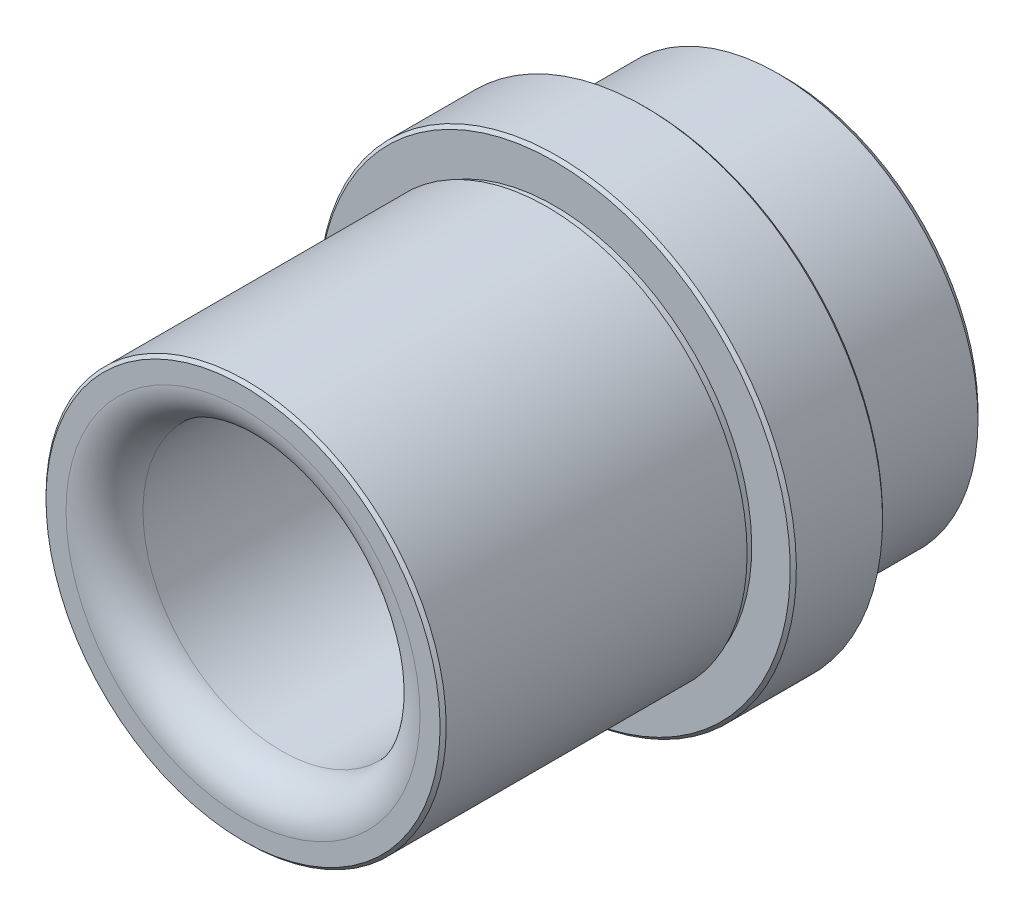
ISO-10303-21;
HEADER;
FILE_DESCRIPTION(('STEP AP214'),'2;1');
FILE_NAME('part.step','',(''),(''),'','','');
FILE_SCHEMA(('AUTOMOTIVE_DESIGN { 1 0 10303 214 1 1 1 1 }'));
ENDSEC;
DATA;
#1=APPLICATION_CONTEXT('core data for automotive mechanical design processes');
#2=APPLICATION_PROTOCOL_DEFINITION('international standard','automotive_design',2000,#1);
#3=PRODUCT_CONTEXT('',#1,'mechanical');
#4=PRODUCT('Part','Part','',(#3));
#5=PRODUCT_RELATED_PRODUCT_CATEGORY('part','',(#4));
#6=PRODUCT_DEFINITION_FORMATION('','',#4);
#7=PRODUCT_DEFINITION_CONTEXT('part definition',#1,'design');
#8=PRODUCT_DEFINITION('design','',#6,#7);
#9=PRODUCT_DEFINITION_SHAPE('','',#8);
#10=(LENGTH_UNIT() NAMED_UNIT(*) SI_UNIT(.MILLI.,.METRE.));
#11=(NAMED_UNIT(*) PLANE_ANGLE_UNIT() SI_UNIT($,.RADIAN.));
#12=(NAMED_UNIT(*) SI_UNIT($,.STERADIAN.) SOLID_ANGLE_UNIT());
#13=UNCERTAINTY_MEASURE_WITH_UNIT(LENGTH_MEASURE(1.E-05),#10,'distance_accuracy_value','');
#14=(GEOMETRIC_REPRESENTATION_CONTEXT(3) GLOBAL_UNCERTAINTY_ASSIGNED_CONTEXT((#13)) GLOBAL_UNIT_ASSIGNED_CONTEXT((#10,
#11,#12)) REPRESENTATION_CONTEXT('',''));
#15=CARTESIAN_POINT('',(0.,0.,0.));
#16=DIRECTION('',(0.,0.,1.));
#17=DIRECTION('',(1.,0.,0.));
#18=AXIS2_PLACEMENT_3D('',#15,#16,#17);
#19=CARTESIAN_POINT('',(0.,15.3,6.25000000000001));
#20=DIRECTION('',(0.,0.,-1.));
#21=DIRECTION('',(0.,1.,0.));
#22=AXIS2_PLACEMENT_3D('',#19,#20,#21);
#23=PLANE('',#22);
#24=CARTESIAN_POINT('',(0.,0.,6.25000000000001));
#25=DIRECTION('',(0.,0.,1.));
#26=DIRECTION('',(0.,-1.,0.));
#27=AXIS2_PLACEMENT_3D('',#24,#25,#26);
#28=CIRCLE('',#27,12.8000000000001);
#29=CARTESIAN_POINT('',(0.,-12.8000000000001,6.25000000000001));
#30=VERTEX_POINT('',#29);
#31=EDGE_CURVE('E89',#30,#30,#28,.T.);
#32=ORIENTED_EDGE('',*,*,#31,.F.);
#33=EDGE_LOOP('',(#32));
#34=FACE_BOUND('',#33,.T.);
#35=CARTESIAN_POINT('',(0.,0.,6.25000000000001));
#36=DIRECTION('',(0.,0.,1.));
#37=DIRECTION('',(0.,-1.,0.));
#38=AXIS2_PLACEMENT_3D('',#35,#36,#37);
#39=CIRCLE('',#38,15.3);
#40=CARTESIAN_POINT('',(0.,-15.3,6.25000000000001));
#41=VERTEX_POINT('',#40);
#42=EDGE_CURVE('E10',#41,#41,#39,.T.);
#43=ORIENTED_EDGE('',*,*,#42,.T.);
#44=EDGE_LOOP('',(#43));
#45=FACE_BOUND('',#44,.T.);
#46=ADVANCED_FACE('F34',(#34,#45),#23,.F.);
#47=CARTESIAN_POINT('',(0.,0.,6.05000000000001));
#48=DIRECTION('',(0.,0.,-1.));
#49=DIRECTION('',(0.,1.,0.));
#50=AXIS2_PLACEMENT_3D('',#47,#48,#49);
#51=CONICAL_SURFACE('',#50,15.5,0.785398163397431);
#52=ORIENTED_EDGE('',*,*,#42,.F.);
#53=EDGE_LOOP('',(#52));
#54=FACE_BOUND('',#53,.T.);
#55=CARTESIAN_POINT('',(0.,0.,6.05000000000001));
#56=DIRECTION('',(0.,0.,1.));
#57=DIRECTION('',(0.,-1.,0.));
#58=AXIS2_PLACEMENT_3D('',#55,#56,#57);
#59=CIRCLE('',#58,15.5);
#60=CARTESIAN_POINT('',(0.,-15.5,6.05000000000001));
#61=VERTEX_POINT('',#60);
#62=EDGE_CURVE('E40',#61,#61,#59,.T.);
#63=ORIENTED_EDGE('',*,*,#62,.T.);
#64=EDGE_LOOP('',(#63));
#65=FACE_BOUND('',#64,.T.);
#66=ADVANCED_FACE('F96',(#54,#65),#51,.T.);
#67=CARTESIAN_POINT('',(0.,0.,26.5));
#68=DIRECTION('',(0.,0.,1.));
#69=DIRECTION('',(0.,-1.,0.));
#70=AXIS2_PLACEMENT_3D('',#67,#68,#69);
#71=CYLINDRICAL_SURFACE('',#70,15.5);
#72=ORIENTED_EDGE('',*,*,#62,.F.);
#73=EDGE_LOOP('',(#72));
#74=FACE_BOUND('',#73,.T.);
#75=CARTESIAN_POINT('',(0.,0.,0.450000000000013));
#76=DIRECTION('',(0.,0.,1.));
#77=DIRECTION('',(0.,-1.,0.));
#78=AXIS2_PLACEMENT_3D('',#75,#76,#77);
#79=CIRCLE('',#78,15.5);
#80=CARTESIAN_POINT('',(0.,-15.5,0.450000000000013));
#81=VERTEX_POINT('',#80);
#82=EDGE_CURVE('E44',#81,#81,#79,.T.);
#83=ORIENTED_EDGE('',*,*,#82,.T.);
#84=EDGE_LOOP('',(#83));
#85=FACE_BOUND('',#84,.T.);
#86=ADVANCED_FACE('F100',(#74,#85),#71,.T.);
#87=CARTESIAN_POINT('',(0.,0.,0.250000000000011));
#88=DIRECTION('',(0.,0.,1.));
#89=DIRECTION('',(0.,-1.,0.));
#90=AXIS2_PLACEMENT_3D('',#87,#88,#89);
#91=CONICAL_SURFACE('',#90,15.3,0.785398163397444);
#92=ORIENTED_EDGE('',*,*,#82,.F.);
#93=EDGE_LOOP('',(#92));
#94=FACE_BOUND('',#93,.T.);
#95=CARTESIAN_POINT('',(0.,0.,0.250000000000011));
#96=DIRECTION('',(0.,0.,1.));
#97=DIRECTION('',(0.,-1.,0.));
#98=AXIS2_PLACEMENT_3D('',#95,#96,#97);
#99=CIRCLE('',#98,15.3);
#100=CARTESIAN_POINT('',(0.,-15.3,0.250000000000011));
#101=VERTEX_POINT('',#100);
#102=EDGE_CURVE('E48',#101,#101,#99,.T.);
#103=ORIENTED_EDGE('',*,*,#102,.T.);
#104=EDGE_LOOP('',(#103));
#105=FACE_BOUND('',#104,.T.);
#106=ADVANCED_FACE('F105',(#94,#105),#91,.T.);
#107=CARTESIAN_POINT('',(0.,12.8000000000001,0.250000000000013));
#108=DIRECTION('',(0.,0.,1.));
#109=DIRECTION('',(0.,-1.,0.));
#110=AXIS2_PLACEMENT_3D('',#107,#108,#109);
#111=PLANE('',#110);
#112=ORIENTED_EDGE('',*,*,#102,.F.);
#113=EDGE_LOOP('',(#112));
#114=FACE_BOUND('',#113,.T.);
#115=CARTESIAN_POINT('',(0.,0.,0.250000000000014));
#116=DIRECTION('',(0.,0.,1.));
#117=DIRECTION('',(0.,-1.,0.));
#118=AXIS2_PLACEMENT_3D('',#115,#116,#117);
#119=CIRCLE('',#118,12.8000000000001);
#120=CARTESIAN_POINT('',(0.,-12.8000000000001,0.250000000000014));
#121=VERTEX_POINT('',#120);
#122=EDGE_CURVE('E53',#121,#121,#119,.T.);
#123=ORIENTED_EDGE('',*,*,#122,.T.);
#124=EDGE_LOOP('',(#123));
#125=FACE_BOUND('',#124,.T.);
#126=ADVANCED_FACE('F111',(#114,#125),#111,.F.);
#127=CARTESIAN_POINT('',(0.,0.,26.5));
#128=DIRECTION('',(0.,0.,1.));
#129=DIRECTION('',(0.,-1.,0.));
#130=AXIS2_PLACEMENT_3D('',#127,#128,#129);
#131=CYLINDRICAL_SURFACE('',#130,12.8000000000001);
#132=ORIENTED_EDGE('',*,*,#122,.F.);
#133=EDGE_LOOP('',(#132));
#134=FACE_BOUND('',#133,.T.);
#135=CARTESIAN_POINT('',(0.,0.,-0.24999999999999));
#136=DIRECTION('',(0.,0.,1.));
#137=DIRECTION('',(0.,-1.,0.));
#138=AXIS2_PLACEMENT_3D('',#135,#136,#137);
#139=CIRCLE('',#138,12.8000000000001);
#140=CARTESIAN_POINT('',(0.,-12.8000000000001,-0.24999999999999));
#141=VERTEX_POINT('',#140);
#142=EDGE_CURVE('E56',#141,#141,#139,.T.);
#143=ORIENTED_EDGE('',*,*,#142,.T.);
#144=EDGE_LOOP('',(#143));
#145=FACE_BOUND('',#144,.T.);
#146=ADVANCED_FACE('F115',(#134,#145),#131,.T.);
#147=CARTESIAN_POINT('',(0.,13.,-0.249999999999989));
#148=DIRECTION('',(0.,0.,-1.));
#149=DIRECTION('',(0.,1.,0.));
#150=AXIS2_PLACEMENT_3D('',#147,#148,#149);
#151=PLANE('',#150);
#152=ORIENTED_EDGE('',*,*,#142,.F.);
#153=EDGE_LOOP('',(#152));
#154=FACE_BOUND('',#153,.T.);
#155=CARTESIAN_POINT('',(0.,0.,-0.24999999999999));
#156=DIRECTION('',(0.,0.,1.));
#157=DIRECTION('',(0.,-1.,0.));
#158=AXIS2_PLACEMENT_3D('',#155,#156,#157);
#159=CIRCLE('',#158,13.);
#160=CARTESIAN_POINT('',(0.,-13.,-0.24999999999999));
#161=VERTEX_POINT('',#160);
#162=EDGE_CURVE('E59',#161,#161,#159,.T.);
#163=ORIENTED_EDGE('',*,*,#162,.T.);
#164=EDGE_LOOP('',(#163));
#165=FACE_BOUND('',#164,.T.);
#166=ADVANCED_FACE('F119',(#154,#165),#151,.F.);
#167=CARTESIAN_POINT('',(0.,0.,26.5));
#168=DIRECTION('',(0.,0.,1.));
#169=DIRECTION('',(0.,-1.,0.));
#170=AXIS2_PLACEMENT_3D('',#167,#168,#169);
#171=CYLINDRICAL_SURFACE('',#170,13.);
#172=ORIENTED_EDGE('',*,*,#162,.F.);
#173=EDGE_LOOP('',(#172));
#174=FACE_BOUND('',#173,.T.);
#175=CARTESIAN_POINT('',(0.,0.,-8.24999999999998));
#176=DIRECTION('',(0.,0.,1.));
#177=DIRECTION('',(0.,-1.,0.));
#178=AXIS2_PLACEMENT_3D('',#175,#176,#177);
#179=CIRCLE('',#178,13.);
#180=CARTESIAN_POINT('',(0.,-13.,-8.24999999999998));
#181=VERTEX_POINT('',#180);
#182=EDGE_CURVE('E62',#181,#181,#179,.T.);
#183=ORIENTED_EDGE('',*,*,#182,.T.);
#184=EDGE_LOOP('',(#183));
#185=FACE_BOUND('',#184,.T.);
#186=ADVANCED_FACE('F123',(#174,#185),#171,.T.);
#187=CARTESIAN_POINT('',(0.,0.,-8.74999999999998));
#188=DIRECTION('',(0.,0.,1.));
#189=DIRECTION('',(0.,-1.,0.));
#190=AXIS2_PLACEMENT_3D('',#187,#188,#189);
#191=CONICAL_SURFACE('',#190,12.5,0.785398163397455);
#192=ORIENTED_EDGE('',*,*,#182,.F.);
#193=EDGE_LOOP('',(#192));
#194=FACE_BOUND('',#193,.T.);
#195=CARTESIAN_POINT('',(0.,0.,-8.74999999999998));
#196=DIRECTION('',(0.,0.,1.));
#197=DIRECTION('',(0.,-1.,0.));
#198=AXIS2_PLACEMENT_3D('',#195,#196,#197);
#199=CIRCLE('',#198,12.5);
#200=CARTESIAN_POINT('',(0.,-12.5,-8.74999999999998));
#201=VERTEX_POINT('',#200);
#202=EDGE_CURVE('E65',#201,#201,#199,.T.);
#203=ORIENTED_EDGE('',*,*,#202,.T.);
#204=EDGE_LOOP('',(#203));
#205=FACE_BOUND('',#204,.T.);
#206=ADVANCED_FACE('F127',(#194,#205),#191,.T.);
#207=CARTESIAN_POINT('',(0.,9.,-8.74999999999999));
#208=DIRECTION('',(0.,0.,1.));
#209=DIRECTION('',(0.,-1.,0.));
#210=AXIS2_PLACEMENT_3D('',#207,#208,#209);
#211=PLANE('',#210);
#212=ORIENTED_EDGE('',*,*,#202,.F.);
#213=EDGE_LOOP('',(#212));
#214=FACE_BOUND('',#213,.T.);
#215=CARTESIAN_POINT('',(0.,0.,-8.74999999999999));
#216=DIRECTION('',(0.,0.,1.));
#217=DIRECTION('',(0.,-1.,0.));
#218=AXIS2_PLACEMENT_3D('',#215,#216,#217);
#219=CIRCLE('',#218,9.);
#220=CARTESIAN_POINT('',(0.,-9.,-8.74999999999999));
#221=VERTEX_POINT('',#220);
#222=EDGE_CURVE('E68',#221,#221,#219,.T.);
#223=ORIENTED_EDGE('',*,*,#222,.T.);
#224=EDGE_LOOP('',(#223));
#225=FACE_BOUND('',#224,.T.);
#226=ADVANCED_FACE('F131',(#214,#225),#211,.F.);
#227=CARTESIAN_POINT('',(0.,0.,26.5));
#228=DIRECTION('',(0.,0.,1.));
#229=DIRECTION('',(0.,-1.,0.));
#230=AXIS2_PLACEMENT_3D('',#227,#228,#229);
#231=CYLINDRICAL_SURFACE('',#230,9.);
#232=ORIENTED_EDGE('',*,*,#222,.F.);
#233=EDGE_LOOP('',(#232));
#234=FACE_BOUND('',#233,.T.);
#235=CARTESIAN_POINT('',(0.,0.,24.));
#236=DIRECTION('',(0.,0.,1.));
#237=DIRECTION('',(0.,-1.,0.));
#238=AXIS2_PLACEMENT_3D('',#235,#236,#237);
#239=CIRCLE('',#238,9.);
#240=CARTESIAN_POINT('',(0.,-9.,24.));
#241=VERTEX_POINT('',#240);
#242=EDGE_CURVE('E71',#241,#241,#239,.T.);
#243=ORIENTED_EDGE('',*,*,#242,.T.);
#244=EDGE_LOOP('',(#243));
#245=FACE_BOUND('',#244,.T.);
#246=ADVANCED_FACE('F135',(#234,#245),#231,.F.);
#247=CARTESIAN_POINT('',(0.,0.,24.));
#248=DIRECTION('',(0.,0.,1.));
#249=DIRECTION('',(0.,-1.,0.));
#250=AXIS2_PLACEMENT_3D('',#247,#248,#249);
#251=TOROIDAL_SURFACE('',#250,11.5,2.5);
#252=ORIENTED_EDGE('',*,*,#242,.F.);
#253=EDGE_LOOP('',(#252));
#254=FACE_BOUND('',#253,.T.);
#255=CARTESIAN_POINT('',(0.,0.,26.5));
#256=DIRECTION('',(0.,0.,1.));
#257=DIRECTION('',(0.,-1.,0.));
#258=AXIS2_PLACEMENT_3D('',#255,#256,#257);
#259=CIRCLE('',#258,11.5);
#260=CARTESIAN_POINT('',(0.,-11.5,26.5));
#261=VERTEX_POINT('',#260);
#262=EDGE_CURVE('E74',#261,#261,#259,.T.);
#263=ORIENTED_EDGE('',*,*,#262,.T.);
#264=EDGE_LOOP('',(#263));
#265=FACE_BOUND('',#264,.T.);
#266=ADVANCED_FACE('F139',(#254,#265),#251,.T.);
#267=CARTESIAN_POINT('',(0.,12.8,26.5));
#268=DIRECTION('',(0.,0.,-1.));
#269=DIRECTION('',(0.,1.,0.));
#270=AXIS2_PLACEMENT_3D('',#267,#268,#269);
#271=PLANE('',#270);
#272=ORIENTED_EDGE('',*,*,#262,.F.);
#273=EDGE_LOOP('',(#272));
#274=FACE_BOUND('',#273,.T.);
#275=CARTESIAN_POINT('',(0.,0.,26.5));
#276=DIRECTION('',(0.,0.,1.));
#277=DIRECTION('',(0.,-1.,0.));
#278=AXIS2_PLACEMENT_3D('',#275,#276,#277);
#279=CIRCLE('',#278,12.8);
#280=CARTESIAN_POINT('',(0.,-12.8,26.5));
#281=VERTEX_POINT('',#280);
#282=EDGE_CURVE('E77',#281,#281,#279,.T.);
#283=ORIENTED_EDGE('',*,*,#282,.T.);
#284=EDGE_LOOP('',(#283));
#285=FACE_BOUND('',#284,.T.);
#286=ADVANCED_FACE('F143',(#274,#285),#271,.F.);
#287=CARTESIAN_POINT('',(0.,0.,26.3));
#288=DIRECTION('',(0.,0.,-1.));
#289=DIRECTION('',(0.,1.,0.));
#290=AXIS2_PLACEMENT_3D('',#287,#288,#289);
#291=CONICAL_SURFACE('',#290,13.,0.785398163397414);
#292=ORIENTED_EDGE('',*,*,#282,.F.);
#293=EDGE_LOOP('',(#292));
#294=FACE_BOUND('',#293,.T.);
#295=CARTESIAN_POINT('',(0.,0.,26.3));
#296=DIRECTION('',(0.,0.,1.));
#297=DIRECTION('',(0.,-1.,0.));
#298=AXIS2_PLACEMENT_3D('',#295,#296,#297);
#299=CIRCLE('',#298,13.);
#300=CARTESIAN_POINT('',(0.,-13.,26.3));
#301=VERTEX_POINT('',#300);
#302=EDGE_CURVE('E80',#301,#301,#299,.T.);
#303=ORIENTED_EDGE('',*,*,#302,.T.);
#304=EDGE_LOOP('',(#303));
#305=FACE_BOUND('',#304,.T.);
#306=ADVANCED_FACE('F147',(#294,#305),#291,.T.);
#307=CARTESIAN_POINT('',(0.,0.,26.5));
#308=DIRECTION('',(0.,0.,1.));
#309=DIRECTION('',(0.,-1.,0.));
#310=AXIS2_PLACEMENT_3D('',#307,#308,#309);
#311=CYLINDRICAL_SURFACE('',#310,13.);
#312=ORIENTED_EDGE('',*,*,#302,.F.);
#313=EDGE_LOOP('',(#312));
#314=FACE_BOUND('',#313,.T.);
#315=CARTESIAN_POINT('',(0.,0.,6.75000000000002));
#316=DIRECTION('',(0.,0.,1.));
#317=DIRECTION('',(0.,-1.,0.));
#318=AXIS2_PLACEMENT_3D('',#315,#316,#317);
#319=CIRCLE('',#318,13.);
#320=CARTESIAN_POINT('',(0.,-13.,6.75000000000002));
#321=VERTEX_POINT('',#320);
#322=EDGE_CURVE('E83',#321,#321,#319,.T.);
#323=ORIENTED_EDGE('',*,*,#322,.T.);
#324=EDGE_LOOP('',(#323));
#325=FACE_BOUND('',#324,.T.);
#326=ADVANCED_FACE('F151',(#314,#325),#311,.T.);
#327=CARTESIAN_POINT('',(0.,12.8000000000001,6.75000000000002));
#328=DIRECTION('',(0.,0.,1.));
#329=DIRECTION('',(0.,-1.,0.));
#330=AXIS2_PLACEMENT_3D('',#327,#328,#329);
#331=PLANE('',#330);
#332=ORIENTED_EDGE('',*,*,#322,.F.);
#333=EDGE_LOOP('',(#332));
#334=FACE_BOUND('',#333,.T.);
#335=CARTESIAN_POINT('',(0.,0.,6.75000000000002));
#336=DIRECTION('',(0.,0.,1.));
#337=DIRECTION('',(0.,-1.,0.));
#338=AXIS2_PLACEMENT_3D('',#335,#336,#337);
#339=CIRCLE('',#338,12.8000000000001);
#340=CARTESIAN_POINT('',(0.,-12.8000000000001,6.75000000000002));
#341=VERTEX_POINT('',#340);
#342=EDGE_CURVE('E86',#341,#341,#339,.T.);
#343=ORIENTED_EDGE('',*,*,#342,.T.);
#344=EDGE_LOOP('',(#343));
#345=FACE_BOUND('',#344,.T.);
#346=ADVANCED_FACE('F155',(#334,#345),#331,.F.);
#347=CARTESIAN_POINT('',(0.,0.,26.5));
#348=DIRECTION('',(0.,0.,1.));
#349=DIRECTION('',(0.,-1.,0.));
#350=AXIS2_PLACEMENT_3D('',#347,#348,#349);
#351=CYLINDRICAL_SURFACE('',#350,12.8000000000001);
#352=ORIENTED_EDGE('',*,*,#342,.F.);
#353=EDGE_LOOP('',(#352));
#354=FACE_BOUND('',#353,.T.);
#355=ORIENTED_EDGE('',*,*,#31,.T.);
#356=EDGE_LOOP('',(#355));
#357=FACE_BOUND('',#356,.T.);
#358=ADVANCED_FACE('F93',(#354,#357),#351,.T.);
#359=CLOSED_SHELL('',(#46,#66,#86,#106,#126,#146,#166,#186,#206,#226,#246,#266,#286,#306,#326,
#346,#358));
#360=MANIFOLD_SOLID_BREP('B2',#359);
#361=ADVANCED_BREP_SHAPE_REPRESENTATION('',(#18,#360),#14);
#362=SHAPE_DEFINITION_REPRESENTATION(#9,#361);
ENDSEC;
END-ISO-10303-21;
